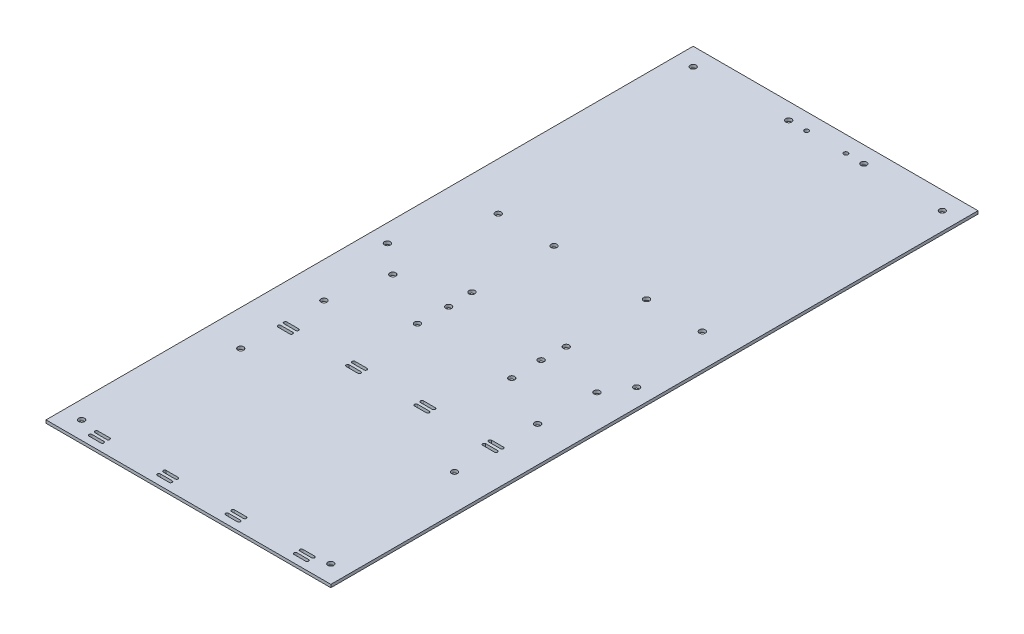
from build123d import *

# Parameters (mm, degrees)
SKETCH1_W           = 304.6625
SKETCH1_H           = 692.15
BOSS_EXTRUDE1_DEPTH = 3.175
SKETCH2_R           = 3.175
CUT_EXTRUDE1_DEPTH  = 3.175
CUT_EXTRUDE7_DEPTH  = 3.175
SKETCH13_R          = 3.175
CUT_EXTRUDE8_DEPTH  = 12.7
CUT_EXTRUDE9_DEPTH  = 1667.582029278
SKETCH15_R          = 2.25
CUT_EXTRUDE10_DEPTH = 1667.582029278
SKETCH16_R          = 3.175
CUT_EXTRUDE11_DEPTH = 1667.582029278
SKETCH17_R          = 3.175
CUT_EXTRUDE12_DEPTH = 1667.582029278
SKETCH18_R          = 3.175
CUT_EXTRUDE13_DEPTH = 1667.582029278


with BuildPart() as part:
    # Sketch1 → Boss-Extrude1 (new body)
    with BuildSketch(Plane.XZ.offset(-277.550649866)):
        with Locations((-759.871620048, 1048.690752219)):
            Rectangle(SKETCH1_W, SKETCH1_H)
    extrude(amount=BOSS_EXTRUDE1_DEPTH)

    # Sketch2 → Cut-Extrude1 (cut)
    with BuildSketch(Plane(origin=(0, 277.550649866, 0), x_dir=(1, 0, 0), z_dir=(0, 1, 0))):
        with Locations(Location((-861.402870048, -961.928252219, 0), (0, 0, 270))):
            Circle(SKETCH2_R)
        with Locations(Location((-801.712870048, -961.928252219, 0), (0, 0, 270))):
            Circle(SKETCH2_R)
        with Locations(Location((-861.402870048, -1074.640752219, 0), (0, 0, 270))):
            Circle(SKETCH2_R)
        with Locations(Location((-801.712870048, -1074.640752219, 0), (0, 0, 270))):
            Circle(SKETCH2_R)
        with Locations(Location((-802.665320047, -1048.728252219, 0), (0, 0, 270))):
            Circle(SKETCH2_R)
        with Locations(Location((-701.815370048, -1048.728252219, 0), (0, 0, 270))):
            Circle(SKETCH2_R)
        with Locations(Location((-702.767870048, -961.928252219, 0), (0, 0, 270))):
            Circle(SKETCH2_R)
        with Locations(Location((-643.077870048, -961.928252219, 0), (0, 0, 270))):
            Circle(SKETCH2_R)
        with Locations(Location((-643.077870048, -1074.640752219, 0), (0, 0, 270))):
            Circle(SKETCH2_R)
        with Locations(Location((-702.767870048, -1074.640752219, 0), (0, 0, 270))):
            Circle(SKETCH2_R)
        with Locations(Location((-701.815370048, -1107.028252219, 0), (0, 0, 270))):
            Circle(SKETCH2_R)
        with Locations(Location((-802.665320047, -1107.028252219, 0), (0, 0, 270))):
            Circle(SKETCH2_R)
    extrude(amount=-CUT_EXTRUDE1_DEPTH, mode=Mode.SUBTRACT)

    # Sketch12 → Cut-Extrude7 (cut)
    with BuildSketch(Plane(origin=(0, 277.550649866, 0), x_dir=(1, 0, 0), z_dir=(0, 1, 0))):
        with BuildLine():
            Line((-874.102870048, -1377.303252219), (-861.402870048, -1377.303252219))
            ThreePointArc((-861.402870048, -1377.303252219), (-859.815370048, -1378.890752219), (-861.402870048, -1380.478252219))
            Line((-861.402870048, -1380.478252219), (-874.102870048, -1380.478252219))
            ThreePointArc((-874.102870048, -1380.478252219), (-875.690370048, -1378.890752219), (-874.102870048, -1377.303252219))
        make_face()
        with BuildLine():
            Line((-801.077870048, -1377.303252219), (-788.377870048, -1377.303252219))
            ThreePointArc((-788.377870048, -1377.303252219), (-786.790370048, -1378.890752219), (-788.377870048, -1380.478252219))
            Line((-788.377870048, -1380.478252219), (-801.077870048, -1380.478252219))
            ThreePointArc((-801.077870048, -1380.478252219), (-802.665370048, -1378.890752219), (-801.077870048, -1377.303252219))
        make_face()
        with BuildLine():
            Line((-728.052870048, -1377.303252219), (-715.352870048, -1377.303252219))
            ThreePointArc((-715.352870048, -1377.303252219), (-713.765370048, -1378.890752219), (-715.352870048, -1380.478252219))
            Line((-715.352870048, -1380.478252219), (-728.052870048, -1380.478252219))
            ThreePointArc((-728.052870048, -1380.478252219), (-729.640370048, -1378.890752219), (-728.052870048, -1377.303252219))
        make_face()
        with BuildLine():
            Line((-655.027870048, -1377.303252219), (-642.327870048, -1377.303252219))
            ThreePointArc((-642.327870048, -1377.303252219), (-640.740370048, -1378.890752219), (-642.327870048, -1380.478252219))
            Line((-642.327870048, -1380.478252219), (-655.027870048, -1380.478252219))
            ThreePointArc((-655.027870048, -1380.478252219), (-656.615370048, -1378.890752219), (-655.027870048, -1377.303252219))
        make_face()
        with BuildLine():
            Line((-655.027870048, -1386.828252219), (-642.327870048, -1386.828252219))
            ThreePointArc((-642.327870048, -1386.828252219), (-640.740370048, -1385.240752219), (-642.327870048, -1383.653252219))
            Line((-642.327870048, -1383.653252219), (-655.027870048, -1383.653252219))
            ThreePointArc((-655.027870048, -1383.653252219), (-656.615370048, -1385.240752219), (-655.027870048, -1386.828252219))
        make_face()
        with BuildLine():
            Line((-728.052870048, -1386.828252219), (-715.352870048, -1386.828252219))
            ThreePointArc((-715.352870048, -1386.828252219), (-713.765370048, -1385.240752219), (-715.352870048, -1383.653252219))
            Line((-715.352870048, -1383.653252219), (-728.052870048, -1383.653252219))
            ThreePointArc((-728.052870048, -1383.653252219), (-729.640370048, -1385.240752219), (-728.052870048, -1386.828252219))
        make_face()
        with BuildLine():
            Line((-801.077870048, -1386.828252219), (-788.377870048, -1386.828252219))
            ThreePointArc((-788.377870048, -1386.828252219), (-786.790370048, -1385.240752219), (-788.377870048, -1383.653252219))
            Line((-788.377870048, -1383.653252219), (-801.077870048, -1383.653252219))
            ThreePointArc((-801.077870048, -1383.653252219), (-802.665370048, -1385.240752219), (-801.077870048, -1386.828252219))
        make_face()
        with BuildLine():
            Line((-874.102870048, -1386.828252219), (-861.402870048, -1386.828252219))
            ThreePointArc((-861.402870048, -1386.828252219), (-859.815370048, -1385.240752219), (-861.402870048, -1383.653252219))
            Line((-861.402870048, -1383.653252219), (-874.102870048, -1383.653252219))
            ThreePointArc((-874.102870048, -1383.653252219), (-875.690370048, -1385.240752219), (-874.102870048, -1386.828252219))
        make_face()
    extrude(amount=-CUT_EXTRUDE7_DEPTH, mode=Mode.SUBTRACT)

    # Sketch13 → Cut-Extrude8 (cut)
    with BuildSketch(Plane(origin=(0, 277.550649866, 0), x_dir=(1, 0, 0), z_dir=(0, 1, 0))):
        with Locations(Location((-874.171620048, -1135.603252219, 0), (0, 0, 270))):
            Circle(SKETCH13_R)
        with Locations(Location((-645.571620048, -1135.603252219, 0), (0, 0, 270))):
            Circle(SKETCH13_R)
        with Locations(Location((-645.571620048, -1224.503252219, 0), (0, 0, 270))):
            Circle(SKETCH13_R)
        with Locations(Location((-874.171620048, -1224.503252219, 0), (0, 0, 270))):
            Circle(SKETCH13_R)
    extrude(amount=-CUT_EXTRUDE8_DEPTH, mode=Mode.SUBTRACT)

    # Sketch14 → Cut-Extrude9 (cut, through all)
    with BuildSketch(Plane(origin=(0, 277.550649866, 0), x_dir=(1, 0, 0), z_dir=(0, 1, 0))):
        with BuildLine():
            Line((-874.102870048, -1181.640752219), (-861.402870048, -1181.640752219))
            ThreePointArc((-861.402870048, -1181.640752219), (-859.815370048, -1183.228252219), (-861.402870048, -1184.815752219))
            Line((-861.402870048, -1184.815752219), (-874.102870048, -1184.815752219))
            ThreePointArc((-874.102870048, -1184.815752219), (-875.690370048, -1183.228252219), (-874.102870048, -1181.640752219))
        make_face()
        with BuildLine():
            Line((-861.402870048, -1178.465752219), (-874.102870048, -1178.465752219))
            ThreePointArc((-874.102870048, -1178.465752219), (-875.690370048, -1176.878252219), (-874.102870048, -1175.290752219))
            Line((-874.102870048, -1175.290752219), (-861.402870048, -1175.290752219))
            ThreePointArc((-861.402870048, -1175.290752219), (-859.815370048, -1176.878252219), (-861.402870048, -1178.465752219))
        make_face()
        with BuildLine():
            Line((-801.077870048, -1175.290752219), (-788.377870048, -1175.290752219))
            ThreePointArc((-788.377870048, -1175.290752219), (-786.790370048, -1176.878252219), (-788.377870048, -1178.465752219))
            Line((-788.377870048, -1178.465752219), (-801.077870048, -1178.465752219))
            ThreePointArc((-801.077870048, -1178.465752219), (-802.665370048, -1176.878252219), (-801.077870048, -1175.290752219))
        make_face()
        with BuildLine():
            Line((-788.377870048, -1184.815752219), (-801.077870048, -1184.815752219))
            ThreePointArc((-801.077870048, -1184.815752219), (-802.665370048, -1183.228252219), (-801.077870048, -1181.640752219))
            Line((-801.077870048, -1181.640752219), (-788.377870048, -1181.640752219))
            ThreePointArc((-788.377870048, -1181.640752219), (-786.790370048, -1183.228252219), (-788.377870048, -1184.815752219))
        make_face()
        with BuildLine():
            Line((-728.052870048, -1181.640752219), (-715.352870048, -1181.640752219))
            ThreePointArc((-715.352870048, -1181.640752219), (-713.765370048, -1183.228252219), (-715.352870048, -1184.815752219))
            Line((-715.352870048, -1184.815752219), (-728.052870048, -1184.815752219))
            ThreePointArc((-728.052870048, -1184.815752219), (-729.640370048, -1183.228252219), (-728.052870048, -1181.640752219))
        make_face()
        with BuildLine():
            Line((-715.352870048, -1178.465752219), (-728.052870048, -1178.465752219))
            ThreePointArc((-728.052870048, -1178.465752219), (-729.640370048, -1176.878252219), (-728.052870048, -1175.290752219))
            Line((-728.052870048, -1175.290752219), (-715.352870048, -1175.290752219))
            ThreePointArc((-715.352870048, -1175.290752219), (-713.765370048, -1176.878252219), (-715.352870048, -1178.465752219))
        make_face()
        with BuildLine():
            Line((-655.027870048, -1175.290752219), (-642.327870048, -1175.290752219))
            ThreePointArc((-642.327870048, -1175.290752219), (-640.740370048, -1176.878252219), (-642.327870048, -1178.465752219))
            Line((-642.327870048, -1178.465752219), (-655.027870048, -1178.465752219))
            ThreePointArc((-655.027870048, -1178.465752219), (-656.615370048, -1176.878252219), (-655.027870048, -1175.290752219))
        make_face()
        with BuildLine():
            Line((-642.327870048, -1184.815752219), (-655.027870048, -1184.815752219))
            ThreePointArc((-655.027870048, -1184.815752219), (-656.615370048, -1183.228252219), (-655.027870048, -1181.640752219))
            Line((-655.027870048, -1181.640752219), (-642.327870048, -1181.640752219))
            ThreePointArc((-642.327870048, -1181.640752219), (-640.740370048, -1183.228252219), (-642.327870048, -1184.815752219))
        make_face()
    extrude(amount=-CUT_EXTRUDE9_DEPTH, mode=Mode.SUBTRACT)

    # Sketch15 → Cut-Extrude10 (cut, through all)
    with BuildSketch(Plane(origin=(0, 277.550649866, 0), x_dir=(1, 0, 0), z_dir=(0, 1, 0))):
        with Locations(Location((-773.240370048, -720.187452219, 0), (0, 0, 270))):
            Circle(SKETCH15_R)
        with Locations(Location((-731.240370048, -720.187452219, 0), (0, 0, 270))):
            Circle(SKETCH15_R)
    extrude(amount=-CUT_EXTRUDE10_DEPTH, mode=Mode.SUBTRACT)

    # Sketch16 → Cut-Extrude11 (cut, through all)
    with BuildSketch(Plane.XZ.offset(-274.375649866)):
        with Locations(Location((-893.152870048, 1375.715752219, 0), (0, 0, 270))):
            Circle(SKETCH16_R)
        with Locations(Location((-626.590370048, 1375.715752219, 0), (0, 0, 270))):
            Circle(SKETCH16_R)
        with Locations(Location((-626.590370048, 721.665752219, 0), (0, 0, 270))):
            Circle(SKETCH16_R)
        with Locations(Location((-893.152870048, 721.665752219, 0), (0, 0, 270))):
            Circle(SKETCH16_R)
    extrude(amount=-CUT_EXTRUDE11_DEPTH, mode=Mode.SUBTRACT)

    # Sketch17 → Cut-Extrude12 (cut, through all)
    with BuildSketch(Plane(origin=(0, 277.550649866, 0), x_dir=(1, 0, 0), z_dir=(0, 1, 0))):
        with Locations(Location((-792.440370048, -720.187452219, 0), (0, 0, 270))):
            Circle(SKETCH17_R)
        with Locations(Location((-712.040370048, -720.187452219, 0), (0, 0, 270))):
            Circle(SKETCH17_R)
    extrude(amount=-CUT_EXTRUDE12_DEPTH, mode=Mode.SUBTRACT)

    # Sketch18 → Cut-Extrude13 (cut, through all)
    with BuildSketch(Plane.XZ.offset(-274.375649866)):
        with Locations(Location((-893.152870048, 1048.690752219, 0), (0, 0, 270))):
            Circle(SKETCH18_R)
        with Locations(Location((-626.590370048, 1048.690752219, 0), (0, 0, 270))):
            Circle(SKETCH18_R)
    extrude(amount=-CUT_EXTRUDE13_DEPTH, mode=Mode.SUBTRACT)


solid = part.part
